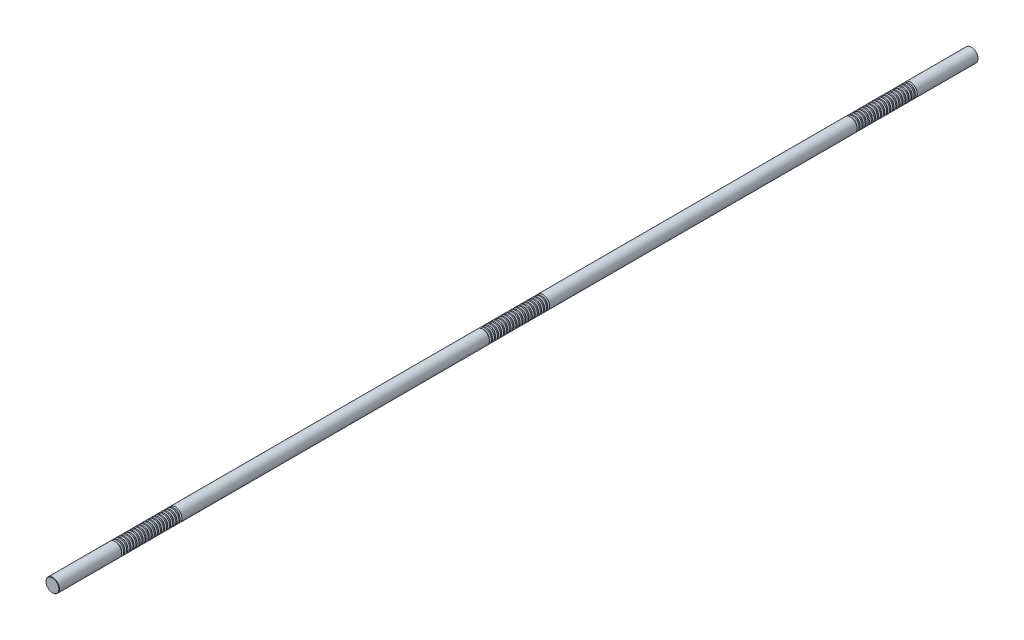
from build123d import *

# Parameters (mm, degrees)
SKETCH1_R           = 11
BOSS_EXTRUDE1_DEPTH = 750
CHAMFER1_SIZE       = 0.55
LPATTERN1_COUNT     = 20
LPATTERN1_PITCH     = 5
LPATTERN2_COUNT     = 3
LPATTERN2_PITCH     = 600


with BuildPart() as part:
    # Sketch1 → Boss-Extrude1 (new, symmetric)
    with BuildSketch(Plane.XY):
        Circle(SKETCH1_R)
    extrude(amount=BOSS_EXTRUDE1_DEPTH, both=True)

    # Chamfer1
    chamfer1_edges = [part.edges().sort_by_distance(p)[0] for p in [
        (-11, 0, -750),
        (-11, 0, 750),
    ]]
    chamfer(chamfer1_edges, length=CHAMFER1_SIZE)

    # Sketch2 → Cut-Revolve1 (revolve, cut)
    with BuildSketch(Plane(origin=(0, 0, 0), x_dir=(0, 0, -1), z_dir=(1, 0, 0)), mode=Mode.PRIVATE) as cut_revolve1_sk:
        Polygon((650.36843014, 11), (647.13156986, 11), (647.86843014, 8.25), (649.63156986, 8.25), align=None)
    cut_revolve1 = revolve(cut_revolve1_sk.sketch.rotate(Axis((0, 0, 750), (0, 0, -1)), 90), axis=Axis((0, 0, 750), (0, 0, -1)), mode=Mode.SUBTRACT)

    # LPattern1: Cut-Revolve1 ×20
    with Locations(*[(0, 0, i * LPATTERN1_PITCH) for i in range(1, LPATTERN1_COUNT)]):
        add(cut_revolve1, mode=Mode.SUBTRACT)

    # LPattern2: Cut-Revolve1 ×3
    with Locations(*[(0, 0, i * LPATTERN2_PITCH) for i in range(1, LPATTERN2_COUNT)]):
        add(cut_revolve1, mode=Mode.SUBTRACT)

    # LPattern2 copy 1 sketch → LPattern2 copy 1 (revolve, cut)
    with BuildSketch(Plane(origin=(0, 0, 605), x_dir=(0, 0, -1), z_dir=(1, 0, 0))):
        Polygon((650.36843014, 11), (647.13156986, 11), (647.86843014, 8.25), (649.63156986, 8.25), align=None)
    revolve(axis=Axis((0, 0, 1355), (0, 0, -1)), mode=Mode.SUBTRACT)

    # LPattern2 copy 2 sketch → LPattern2 copy 2 (revolve, cut)
    with BuildSketch(Plane(origin=(0, 0, 1205), x_dir=(0, 0, -1), z_dir=(1, 0, 0))):
        Polygon((650.36843014, 11), (647.13156986, 11), (647.86843014, 8.25), (649.63156986, 8.25), align=None)
    revolve(axis=Axis((0, 0, 1955), (0, 0, -1)), mode=Mode.SUBTRACT)

    # LPattern2 copy 3 sketch → LPattern2 copy 3 (revolve, cut)
    with BuildSketch(Plane(origin=(0, 0, 610), x_dir=(0, 0, -1), z_dir=(1, 0, 0))):
        Polygon((650.36843014, 11), (647.13156986, 11), (647.86843014, 8.25), (649.63156986, 8.25), align=None)
    revolve(axis=Axis((0, 0, 1360), (0, 0, -1)), mode=Mode.SUBTRACT)

    # LPattern2 copy 4 sketch → LPattern2 copy 4 (revolve, cut)
    with BuildSketch(Plane(origin=(0, 0, 1210), x_dir=(0, 0, -1), z_dir=(1, 0, 0))):
        Polygon((650.36843014, 11), (647.13156986, 11), (647.86843014, 8.25), (649.63156986, 8.25), align=None)
    revolve(axis=Axis((0, 0, 1960), (0, 0, -1)), mode=Mode.SUBTRACT)

    # LPattern2 copy 5 sketch → LPattern2 copy 5 (revolve, cut)
    with BuildSketch(Plane(origin=(0, 0, 615), x_dir=(0, 0, -1), z_dir=(1, 0, 0))):
        Polygon((650.36843014, 11), (647.13156986, 11), (647.86843014, 8.25), (649.63156986, 8.25), align=None)
    revolve(axis=Axis((0, 0, 1365), (0, 0, -1)), mode=Mode.SUBTRACT)

    # LPattern2 copy 6 sketch → LPattern2 copy 6 (revolve, cut)
    with BuildSketch(Plane(origin=(0, 0, 1215), x_dir=(0, 0, -1), z_dir=(1, 0, 0))):
        Polygon((650.36843014, 11), (647.13156986, 11), (647.86843014, 8.25), (649.63156986, 8.25), align=None)
    revolve(axis=Axis((0, 0, 1965), (0, 0, -1)), mode=Mode.SUBTRACT)

    # LPattern2 copy 7 sketch → LPattern2 copy 7 (revolve, cut)
    with BuildSketch(Plane(origin=(0, 0, 620), x_dir=(0, 0, -1), z_dir=(1, 0, 0))):
        Polygon((650.36843014, 11), (647.13156986, 11), (647.86843014, 8.25), (649.63156986, 8.25), align=None)
    revolve(axis=Axis((0, 0, 1370), (0, 0, -1)), mode=Mode.SUBTRACT)

    # LPattern2 copy 8 sketch → LPattern2 copy 8 (revolve, cut)
    with BuildSketch(Plane(origin=(0, 0, 1220), x_dir=(0, 0, -1), z_dir=(1, 0, 0))):
        Polygon((650.36843014, 11), (647.13156986, 11), (647.86843014, 8.25), (649.63156986, 8.25), align=None)
    revolve(axis=Axis((0, 0, 1970), (0, 0, -1)), mode=Mode.SUBTRACT)

    # LPattern2 copy 9 sketch → LPattern2 copy 9 (revolve, cut)
    with BuildSketch(Plane(origin=(0, 0, 625), x_dir=(0, 0, -1), z_dir=(1, 0, 0))):
        Polygon((650.36843014, 11), (647.13156986, 11), (647.86843014, 8.25), (649.63156986, 8.25), align=None)
    revolve(axis=Axis((0, 0, 1375), (0, 0, -1)), mode=Mode.SUBTRACT)

    # LPattern2 copy 10 sketch → LPattern2 copy 10 (revolve, cut)
    with BuildSketch(Plane(origin=(0, 0, 1225), x_dir=(0, 0, -1), z_dir=(1, 0, 0))):
        Polygon((650.36843014, 11), (647.13156986, 11), (647.86843014, 8.25), (649.63156986, 8.25), align=None)
    revolve(axis=Axis((0, 0, 1975), (0, 0, -1)), mode=Mode.SUBTRACT)

    # LPattern2 copy 11 sketch → LPattern2 copy 11 (revolve, cut)
    with BuildSketch(Plane(origin=(0, 0, 630), x_dir=(0, 0, -1), z_dir=(1, 0, 0))):
        Polygon((650.36843014, 11), (647.13156986, 11), (647.86843014, 8.25), (649.63156986, 8.25), align=None)
    revolve(axis=Axis((0, 0, 1380), (0, 0, -1)), mode=Mode.SUBTRACT)

    # LPattern2 copy 12 sketch → LPattern2 copy 12 (revolve, cut)
    with BuildSketch(Plane(origin=(0, 0, 1230), x_dir=(0, 0, -1), z_dir=(1, 0, 0))):
        Polygon((650.36843014, 11), (647.13156986, 11), (647.86843014, 8.25), (649.63156986, 8.25), align=None)
    revolve(axis=Axis((0, 0, 1980), (0, 0, -1)), mode=Mode.SUBTRACT)

    # LPattern2 copy 13 sketch → LPattern2 copy 13 (revolve, cut)
    with BuildSketch(Plane(origin=(0, 0, 635), x_dir=(0, 0, -1), z_dir=(1, 0, 0))):
        Polygon((650.36843014, 11), (647.13156986, 11), (647.86843014, 8.25), (649.63156986, 8.25), align=None)
    revolve(axis=Axis((0, 0, 1385), (0, 0, -1)), mode=Mode.SUBTRACT)

    # LPattern2 copy 14 sketch → LPattern2 copy 14 (revolve, cut)
    with BuildSketch(Plane(origin=(0, 0, 1235), x_dir=(0, 0, -1), z_dir=(1, 0, 0))):
        Polygon((650.36843014, 11), (647.13156986, 11), (647.86843014, 8.25), (649.63156986, 8.25), align=None)
    revolve(axis=Axis((0, 0, 1985), (0, 0, -1)), mode=Mode.SUBTRACT)

    # LPattern2 copy 15 sketch → LPattern2 copy 15 (revolve, cut)
    with BuildSketch(Plane(origin=(0, 0, 640), x_dir=(0, 0, -1), z_dir=(1, 0, 0))):
        Polygon((650.36843014, 11), (647.13156986, 11), (647.86843014, 8.25), (649.63156986, 8.25), align=None)
    revolve(axis=Axis((0, 0, 1390), (0, 0, -1)), mode=Mode.SUBTRACT)

    # LPattern2 copy 16 sketch → LPattern2 copy 16 (revolve, cut)
    with BuildSketch(Plane(origin=(0, 0, 1240), x_dir=(0, 0, -1), z_dir=(1, 0, 0))):
        Polygon((650.36843014, 11), (647.13156986, 11), (647.86843014, 8.25), (649.63156986, 8.25), align=None)
    revolve(axis=Axis((0, 0, 1990), (0, 0, -1)), mode=Mode.SUBTRACT)

    # LPattern2 copy 17 sketch → LPattern2 copy 17 (revolve, cut)
    with BuildSketch(Plane(origin=(0, 0, 645), x_dir=(0, 0, -1), z_dir=(1, 0, 0))):
        Polygon((650.36843014, 11), (647.13156986, 11), (647.86843014, 8.25), (649.63156986, 8.25), align=None)
    revolve(axis=Axis((0, 0, 1395), (0, 0, -1)), mode=Mode.SUBTRACT)

    # LPattern2 copy 18 sketch → LPattern2 copy 18 (revolve, cut)
    with BuildSketch(Plane(origin=(0, 0, 1245), x_dir=(0, 0, -1), z_dir=(1, 0, 0))):
        Polygon((650.36843014, 11), (647.13156986, 11), (647.86843014, 8.25), (649.63156986, 8.25), align=None)
    revolve(axis=Axis((0, 0, 1995), (0, 0, -1)), mode=Mode.SUBTRACT)

    # LPattern2 copy 19 sketch → LPattern2 copy 19 (revolve, cut)
    with BuildSketch(Plane(origin=(0, 0, 650), x_dir=(0, 0, -1), z_dir=(1, 0, 0))):
        Polygon((650.36843014, 11), (647.13156986, 11), (647.86843014, 8.25), (649.63156986, 8.25), align=None)
    revolve(axis=Axis((0, 0, 1400), (0, 0, -1)), mode=Mode.SUBTRACT)

    # LPattern2 copy 20 sketch → LPattern2 copy 20 (revolve, cut)
    with BuildSketch(Plane(origin=(0, 0, 1250), x_dir=(0, 0, -1), z_dir=(1, 0, 0))):
        Polygon((650.36843014, 11), (647.13156986, 11), (647.86843014, 8.25), (649.63156986, 8.25), align=None)
    revolve(axis=Axis((0, 0, 2000), (0, 0, -1)), mode=Mode.SUBTRACT)

    # LPattern2 copy 21 sketch → LPattern2 copy 21 (revolve, cut)
    with BuildSketch(Plane(origin=(0, 0, 655), x_dir=(0, 0, -1), z_dir=(1, 0, 0))):
        Polygon((650.36843014, 11), (647.13156986, 11), (647.86843014, 8.25), (649.63156986, 8.25), align=None)
    revolve(axis=Axis((0, 0, 1405), (0, 0, -1)), mode=Mode.SUBTRACT)

    # LPattern2 copy 22 sketch → LPattern2 copy 22 (revolve, cut)
    with BuildSketch(Plane(origin=(0, 0, 1255), x_dir=(0, 0, -1), z_dir=(1, 0, 0))):
        Polygon((650.36843014, 11), (647.13156986, 11), (647.86843014, 8.25), (649.63156986, 8.25), align=None)
    revolve(axis=Axis((0, 0, 2005), (0, 0, -1)), mode=Mode.SUBTRACT)

    # LPattern2 copy 23 sketch → LPattern2 copy 23 (revolve, cut)
    with BuildSketch(Plane(origin=(0, 0, 660), x_dir=(0, 0, -1), z_dir=(1, 0, 0))):
        Polygon((650.36843014, 11), (647.13156986, 11), (647.86843014, 8.25), (649.63156986, 8.25), align=None)
    revolve(axis=Axis((0, 0, 1410), (0, 0, -1)), mode=Mode.SUBTRACT)

    # LPattern2 copy 24 sketch → LPattern2 copy 24 (revolve, cut)
    with BuildSketch(Plane(origin=(0, 0, 1260), x_dir=(0, 0, -1), z_dir=(1, 0, 0))):
        Polygon((650.36843014, 11), (647.13156986, 11), (647.86843014, 8.25), (649.63156986, 8.25), align=None)
    revolve(axis=Axis((0, 0, 2010), (0, 0, -1)), mode=Mode.SUBTRACT)

    # LPattern2 copy 25 sketch → LPattern2 copy 25 (revolve, cut)
    with BuildSketch(Plane(origin=(0, 0, 665), x_dir=(0, 0, -1), z_dir=(1, 0, 0))):
        Polygon((650.36843014, 11), (647.13156986, 11), (647.86843014, 8.25), (649.63156986, 8.25), align=None)
    revolve(axis=Axis((0, 0, 1415), (0, 0, -1)), mode=Mode.SUBTRACT)

    # LPattern2 copy 26 sketch → LPattern2 copy 26 (revolve, cut)
    with BuildSketch(Plane(origin=(0, 0, 1265), x_dir=(0, 0, -1), z_dir=(1, 0, 0))):
        Polygon((650.36843014, 11), (647.13156986, 11), (647.86843014, 8.25), (649.63156986, 8.25), align=None)
    revolve(axis=Axis((0, 0, 2015), (0, 0, -1)), mode=Mode.SUBTRACT)

    # LPattern2 copy 27 sketch → LPattern2 copy 27 (revolve, cut)
    with BuildSketch(Plane(origin=(0, 0, 670), x_dir=(0, 0, -1), z_dir=(1, 0, 0))):
        Polygon((650.36843014, 11), (647.13156986, 11), (647.86843014, 8.25), (649.63156986, 8.25), align=None)
    revolve(axis=Axis((0, 0, 1420), (0, 0, -1)), mode=Mode.SUBTRACT)

    # LPattern2 copy 28 sketch → LPattern2 copy 28 (revolve, cut)
    with BuildSketch(Plane(origin=(0, 0, 1270), x_dir=(0, 0, -1), z_dir=(1, 0, 0))):
        Polygon((650.36843014, 11), (647.13156986, 11), (647.86843014, 8.25), (649.63156986, 8.25), align=None)
    revolve(axis=Axis((0, 0, 2020), (0, 0, -1)), mode=Mode.SUBTRACT)

    # LPattern2 copy 29 sketch → LPattern2 copy 29 (revolve, cut)
    with BuildSketch(Plane(origin=(0, 0, 675), x_dir=(0, 0, -1), z_dir=(1, 0, 0))):
        Polygon((650.36843014, 11), (647.13156986, 11), (647.86843014, 8.25), (649.63156986, 8.25), align=None)
    revolve(axis=Axis((0, 0, 1425), (0, 0, -1)), mode=Mode.SUBTRACT)

    # LPattern2 copy 30 sketch → LPattern2 copy 30 (revolve, cut)
    with BuildSketch(Plane(origin=(0, 0, 1275), x_dir=(0, 0, -1), z_dir=(1, 0, 0))):
        Polygon((650.36843014, 11), (647.13156986, 11), (647.86843014, 8.25), (649.63156986, 8.25), align=None)
    revolve(axis=Axis((0, 0, 2025), (0, 0, -1)), mode=Mode.SUBTRACT)

    # LPattern2 copy 31 sketch → LPattern2 copy 31 (revolve, cut)
    with BuildSketch(Plane(origin=(0, 0, 680), x_dir=(0, 0, -1), z_dir=(1, 0, 0))):
        Polygon((650.36843014, 11), (647.13156986, 11), (647.86843014, 8.25), (649.63156986, 8.25), align=None)
    revolve(axis=Axis((0, 0, 1430), (0, 0, -1)), mode=Mode.SUBTRACT)

    # LPattern2 copy 32 sketch → LPattern2 copy 32 (revolve, cut)
    with BuildSketch(Plane(origin=(0, 0, 1280), x_dir=(0, 0, -1), z_dir=(1, 0, 0))):
        Polygon((650.36843014, 11), (647.13156986, 11), (647.86843014, 8.25), (649.63156986, 8.25), align=None)
    revolve(axis=Axis((0, 0, 2030), (0, 0, -1)), mode=Mode.SUBTRACT)

    # LPattern2 copy 33 sketch → LPattern2 copy 33 (revolve, cut)
    with BuildSketch(Plane(origin=(0, 0, 685), x_dir=(0, 0, -1), z_dir=(1, 0, 0))):
        Polygon((650.36843014, 11), (647.13156986, 11), (647.86843014, 8.25), (649.63156986, 8.25), align=None)
    revolve(axis=Axis((0, 0, 1435), (0, 0, -1)), mode=Mode.SUBTRACT)

    # LPattern2 copy 34 sketch → LPattern2 copy 34 (revolve, cut)
    with BuildSketch(Plane(origin=(0, 0, 1285), x_dir=(0, 0, -1), z_dir=(1, 0, 0))):
        Polygon((650.36843014, 11), (647.13156986, 11), (647.86843014, 8.25), (649.63156986, 8.25), align=None)
    revolve(axis=Axis((0, 0, 2035), (0, 0, -1)), mode=Mode.SUBTRACT)

    # LPattern2 copy 35 sketch → LPattern2 copy 35 (revolve, cut)
    with BuildSketch(Plane(origin=(0, 0, 690), x_dir=(0, 0, -1), z_dir=(1, 0, 0))):
        Polygon((650.36843014, 11), (647.13156986, 11), (647.86843014, 8.25), (649.63156986, 8.25), align=None)
    revolve(axis=Axis((0, 0, 1440), (0, 0, -1)), mode=Mode.SUBTRACT)

    # LPattern2 copy 36 sketch → LPattern2 copy 36 (revolve, cut)
    with BuildSketch(Plane(origin=(0, 0, 1290), x_dir=(0, 0, -1), z_dir=(1, 0, 0))):
        Polygon((650.36843014, 11), (647.13156986, 11), (647.86843014, 8.25), (649.63156986, 8.25), align=None)
    revolve(axis=Axis((0, 0, 2040), (0, 0, -1)), mode=Mode.SUBTRACT)

    # LPattern2 copy 37 sketch → LPattern2 copy 37 (revolve, cut)
    with BuildSketch(Plane(origin=(0, 0, 695), x_dir=(0, 0, -1), z_dir=(1, 0, 0))):
        Polygon((650.36843014, 11), (647.13156986, 11), (647.86843014, 8.25), (649.63156986, 8.25), align=None)
    revolve(axis=Axis((0, 0, 1445), (0, 0, -1)), mode=Mode.SUBTRACT)

    # LPattern2 copy 38 sketch → LPattern2 copy 38 (revolve, cut)
    with BuildSketch(Plane(origin=(0, 0, 1295), x_dir=(0, 0, -1), z_dir=(1, 0, 0))):
        Polygon((650.36843014, 11), (647.13156986, 11), (647.86843014, 8.25), (649.63156986, 8.25), align=None)
    revolve(axis=Axis((0, 0, 2045), (0, 0, -1)), mode=Mode.SUBTRACT)


solid = part.part
